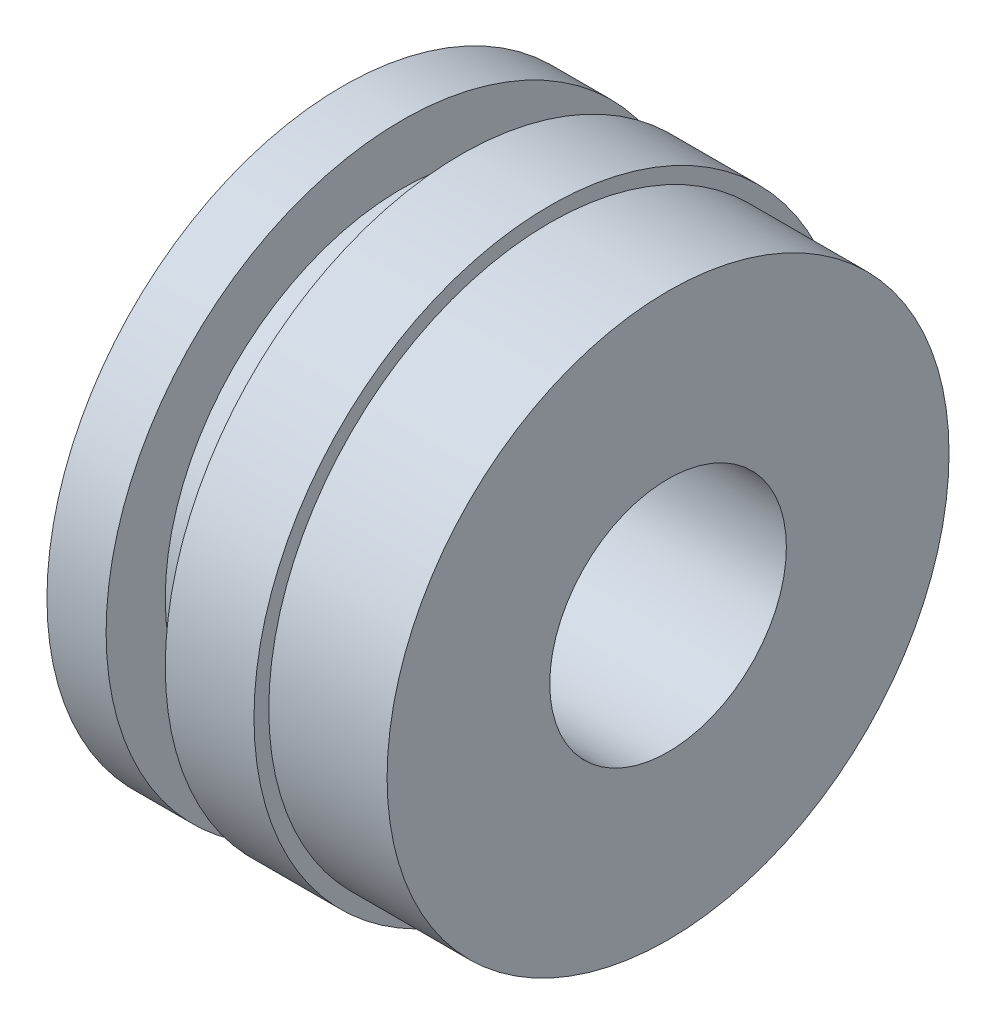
ISO-10303-21;
HEADER;
FILE_DESCRIPTION(('STEP AP214'),'2;1');
FILE_NAME('part.step','',(''),(''),'','','');
FILE_SCHEMA(('AUTOMOTIVE_DESIGN { 1 0 10303 214 1 1 1 1 }'));
ENDSEC;
DATA;
#1=APPLICATION_CONTEXT('core data for automotive mechanical design processes');
#2=APPLICATION_PROTOCOL_DEFINITION('international standard','automotive_design',2000,#1);
#3=PRODUCT_CONTEXT('',#1,'mechanical');
#4=PRODUCT('Part','Part','',(#3));
#5=PRODUCT_RELATED_PRODUCT_CATEGORY('part','',(#4));
#6=PRODUCT_DEFINITION_FORMATION('','',#4);
#7=PRODUCT_DEFINITION_CONTEXT('part definition',#1,'design');
#8=PRODUCT_DEFINITION('design','',#6,#7);
#9=PRODUCT_DEFINITION_SHAPE('','',#8);
#10=(LENGTH_UNIT() NAMED_UNIT(*) SI_UNIT(.MILLI.,.METRE.));
#11=(NAMED_UNIT(*) PLANE_ANGLE_UNIT() SI_UNIT($,.RADIAN.));
#12=(NAMED_UNIT(*) SI_UNIT($,.STERADIAN.) SOLID_ANGLE_UNIT());
#13=UNCERTAINTY_MEASURE_WITH_UNIT(LENGTH_MEASURE(1.E-05),#10,'distance_accuracy_value','');
#14=(GEOMETRIC_REPRESENTATION_CONTEXT(3) GLOBAL_UNCERTAINTY_ASSIGNED_CONTEXT((#13)) GLOBAL_UNIT_ASSIGNED_CONTEXT((#10,
#11,#12)) REPRESENTATION_CONTEXT('',''));
#15=CARTESIAN_POINT('',(0.,0.,0.));
#16=DIRECTION('',(0.,0.,1.));
#17=DIRECTION('',(1.,0.,0.));
#18=AXIS2_PLACEMENT_3D('',#15,#16,#17);
#19=CARTESIAN_POINT('',(0.,4.,0.));
#20=DIRECTION('',(1.,0.,0.));
#21=DIRECTION('',(0.,0.,-1.));
#22=AXIS2_PLACEMENT_3D('',#19,#20,#21);
#23=PLANE('',#22);
#24=CARTESIAN_POINT('',(0.,0.,0.));
#25=DIRECTION('',(-1.,0.,0.));
#26=DIRECTION('',(0.,0.,1.));
#27=AXIS2_PLACEMENT_3D('',#24,#25,#26);
#28=CIRCLE('',#27,4.);
#29=CARTESIAN_POINT('',(0.,0.,4.));
#30=VERTEX_POINT('',#29);
#31=EDGE_CURVE('E61',#30,#30,#28,.T.);
#32=ORIENTED_EDGE('',*,*,#31,.F.);
#33=EDGE_LOOP('',(#32));
#34=FACE_BOUND('',#33,.T.);
#35=CARTESIAN_POINT('',(0.,0.,0.));
#36=DIRECTION('',(-1.,0.,0.));
#37=DIRECTION('',(0.,0.,1.));
#38=AXIS2_PLACEMENT_3D('',#35,#36,#37);
#39=CIRCLE('',#38,10.);
#40=CARTESIAN_POINT('',(0.,0.,10.));
#41=VERTEX_POINT('',#40);
#42=EDGE_CURVE('E10',#41,#41,#39,.T.);
#43=ORIENTED_EDGE('',*,*,#42,.T.);
#44=EDGE_LOOP('',(#43));
#45=FACE_BOUND('',#44,.T.);
#46=ADVANCED_FACE('F27',(#34,#45),#23,.F.);
#47=CARTESIAN_POINT('',(-25.,0.,0.));
#48=DIRECTION('',(-1.,0.,0.));
#49=DIRECTION('',(0.,0.,1.));
#50=AXIS2_PLACEMENT_3D('',#47,#48,#49);
#51=CYLINDRICAL_SURFACE('',#50,10.);
#52=ORIENTED_EDGE('',*,*,#42,.F.);
#53=EDGE_LOOP('',(#52));
#54=FACE_BOUND('',#53,.T.);
#55=CARTESIAN_POINT('',(2.,0.,0.));
#56=DIRECTION('',(-1.,0.,0.));
#57=DIRECTION('',(0.,0.,1.));
#58=AXIS2_PLACEMENT_3D('',#55,#56,#57);
#59=CIRCLE('',#58,10.);
#60=CARTESIAN_POINT('',(2.,0.,10.));
#61=VERTEX_POINT('',#60);
#62=EDGE_CURVE('E33',#61,#61,#59,.T.);
#63=ORIENTED_EDGE('',*,*,#62,.T.);
#64=EDGE_LOOP('',(#63));
#65=FACE_BOUND('',#64,.T.);
#66=ADVANCED_FACE('F68',(#54,#65),#51,.T.);
#67=CARTESIAN_POINT('',(2.,10.,0.));
#68=DIRECTION('',(-1.,0.,0.));
#69=DIRECTION('',(0.,0.,1.));
#70=AXIS2_PLACEMENT_3D('',#67,#68,#69);
#71=PLANE('',#70);
#72=ORIENTED_EDGE('',*,*,#62,.F.);
#73=EDGE_LOOP('',(#72));
#74=FACE_BOUND('',#73,.T.);
#75=CARTESIAN_POINT('',(2.,0.,0.));
#76=DIRECTION('',(-1.,0.,0.));
#77=DIRECTION('',(0.,0.,1.));
#78=AXIS2_PLACEMENT_3D('',#75,#76,#77);
#79=CIRCLE('',#78,8.);
#80=CARTESIAN_POINT('',(2.,0.,8.));
#81=VERTEX_POINT('',#80);
#82=EDGE_CURVE('E37',#81,#81,#79,.T.);
#83=ORIENTED_EDGE('',*,*,#82,.T.);
#84=EDGE_LOOP('',(#83));
#85=FACE_BOUND('',#84,.T.);
#86=ADVANCED_FACE('F72',(#74,#85),#71,.F.);
#87=CARTESIAN_POINT('',(-25.,0.,0.));
#88=DIRECTION('',(-1.,0.,0.));
#89=DIRECTION('',(0.,0.,1.));
#90=AXIS2_PLACEMENT_3D('',#87,#88,#89);
#91=CYLINDRICAL_SURFACE('',#90,8.);
#92=ORIENTED_EDGE('',*,*,#82,.F.);
#93=EDGE_LOOP('',(#92));
#94=FACE_BOUND('',#93,.T.);
#95=CARTESIAN_POINT('',(4.,0.,0.));
#96=DIRECTION('',(-1.,0.,0.));
#97=DIRECTION('',(0.,0.,1.));
#98=AXIS2_PLACEMENT_3D('',#95,#96,#97);
#99=CIRCLE('',#98,8.);
#100=CARTESIAN_POINT('',(4.,0.,8.));
#101=VERTEX_POINT('',#100);
#102=EDGE_CURVE('E41',#101,#101,#99,.T.);
#103=ORIENTED_EDGE('',*,*,#102,.T.);
#104=EDGE_LOOP('',(#103));
#105=FACE_BOUND('',#104,.T.);
#106=ADVANCED_FACE('F77',(#94,#105),#91,.T.);
#107=CARTESIAN_POINT('',(4.,8.,0.));
#108=DIRECTION('',(1.,0.,0.));
#109=DIRECTION('',(0.,0.,-1.));
#110=AXIS2_PLACEMENT_3D('',#107,#108,#109);
#111=PLANE('',#110);
#112=ORIENTED_EDGE('',*,*,#102,.F.);
#113=EDGE_LOOP('',(#112));
#114=FACE_BOUND('',#113,.T.);
#115=CARTESIAN_POINT('',(4.,0.,0.));
#116=DIRECTION('',(-1.,0.,0.));
#117=DIRECTION('',(0.,0.,1.));
#118=AXIS2_PLACEMENT_3D('',#115,#116,#117);
#119=CIRCLE('',#118,10.);
#120=CARTESIAN_POINT('',(4.,0.,10.));
#121=VERTEX_POINT('',#120);
#122=EDGE_CURVE('E46',#121,#121,#119,.T.);
#123=ORIENTED_EDGE('',*,*,#122,.T.);
#124=EDGE_LOOP('',(#123));
#125=FACE_BOUND('',#124,.T.);
#126=ADVANCED_FACE('F83',(#114,#125),#111,.F.);
#127=CARTESIAN_POINT('',(-25.,0.,0.));
#128=DIRECTION('',(-1.,0.,0.));
#129=DIRECTION('',(0.,0.,1.));
#130=AXIS2_PLACEMENT_3D('',#127,#128,#129);
#131=CYLINDRICAL_SURFACE('',#130,10.);
#132=ORIENTED_EDGE('',*,*,#122,.F.);
#133=EDGE_LOOP('',(#132));
#134=FACE_BOUND('',#133,.T.);
#135=CARTESIAN_POINT('',(7.,0.,0.));
#136=DIRECTION('',(-1.,0.,0.));
#137=DIRECTION('',(0.,0.,1.));
#138=AXIS2_PLACEMENT_3D('',#135,#136,#137);
#139=CIRCLE('',#138,10.);
#140=CARTESIAN_POINT('',(7.,0.,10.));
#141=VERTEX_POINT('',#140);
#142=EDGE_CURVE('E49',#141,#141,#139,.T.);
#143=ORIENTED_EDGE('',*,*,#142,.T.);
#144=EDGE_LOOP('',(#143));
#145=FACE_BOUND('',#144,.T.);
#146=ADVANCED_FACE('F87',(#134,#145),#131,.T.);
#147=CARTESIAN_POINT('',(7.,10.,0.));
#148=DIRECTION('',(-1.,0.,0.));
#149=DIRECTION('',(0.,0.,1.));
#150=AXIS2_PLACEMENT_3D('',#147,#148,#149);
#151=PLANE('',#150);
#152=ORIENTED_EDGE('',*,*,#142,.F.);
#153=EDGE_LOOP('',(#152));
#154=FACE_BOUND('',#153,.T.);
#155=CARTESIAN_POINT('',(7.,0.,0.));
#156=DIRECTION('',(-1.,0.,0.));
#157=DIRECTION('',(0.,0.,1.));
#158=AXIS2_PLACEMENT_3D('',#155,#156,#157);
#159=CIRCLE('',#158,9.5);
#160=CARTESIAN_POINT('',(7.,0.,9.5));
#161=VERTEX_POINT('',#160);
#162=EDGE_CURVE('E52',#161,#161,#159,.T.);
#163=ORIENTED_EDGE('',*,*,#162,.T.);
#164=EDGE_LOOP('',(#163));
#165=FACE_BOUND('',#164,.T.);
#166=ADVANCED_FACE('F91',(#154,#165),#151,.F.);
#167=CARTESIAN_POINT('',(-25.,0.,0.));
#168=DIRECTION('',(-1.,0.,0.));
#169=DIRECTION('',(0.,0.,1.));
#170=AXIS2_PLACEMENT_3D('',#167,#168,#169);
#171=CYLINDRICAL_SURFACE('',#170,9.5);
#172=ORIENTED_EDGE('',*,*,#162,.F.);
#173=EDGE_LOOP('',(#172));
#174=FACE_BOUND('',#173,.T.);
#175=CARTESIAN_POINT('',(11.,0.,0.));
#176=DIRECTION('',(-1.,0.,0.));
#177=DIRECTION('',(0.,0.,1.));
#178=AXIS2_PLACEMENT_3D('',#175,#176,#177);
#179=CIRCLE('',#178,9.5);
#180=CARTESIAN_POINT('',(11.,0.,9.5));
#181=VERTEX_POINT('',#180);
#182=EDGE_CURVE('E55',#181,#181,#179,.T.);
#183=ORIENTED_EDGE('',*,*,#182,.T.);
#184=EDGE_LOOP('',(#183));
#185=FACE_BOUND('',#184,.T.);
#186=ADVANCED_FACE('F95',(#174,#185),#171,.T.);
#187=CARTESIAN_POINT('',(11.,9.5,0.));
#188=DIRECTION('',(-1.,0.,0.));
#189=DIRECTION('',(0.,0.,1.));
#190=AXIS2_PLACEMENT_3D('',#187,#188,#189);
#191=PLANE('',#190);
#192=ORIENTED_EDGE('',*,*,#182,.F.);
#193=EDGE_LOOP('',(#192));
#194=FACE_BOUND('',#193,.T.);
#195=CARTESIAN_POINT('',(11.,0.,0.));
#196=DIRECTION('',(-1.,0.,0.));
#197=DIRECTION('',(0.,0.,1.));
#198=AXIS2_PLACEMENT_3D('',#195,#196,#197);
#199=CIRCLE('',#198,4.);
#200=CARTESIAN_POINT('',(11.,0.,4.));
#201=VERTEX_POINT('',#200);
#202=EDGE_CURVE('E58',#201,#201,#199,.T.);
#203=ORIENTED_EDGE('',*,*,#202,.T.);
#204=EDGE_LOOP('',(#203));
#205=FACE_BOUND('',#204,.T.);
#206=ADVANCED_FACE('F99',(#194,#205),#191,.F.);
#207=CARTESIAN_POINT('',(-25.,0.,0.));
#208=DIRECTION('',(-1.,0.,0.));
#209=DIRECTION('',(0.,0.,1.));
#210=AXIS2_PLACEMENT_3D('',#207,#208,#209);
#211=CYLINDRICAL_SURFACE('',#210,4.);
#212=ORIENTED_EDGE('',*,*,#202,.F.);
#213=EDGE_LOOP('',(#212));
#214=FACE_BOUND('',#213,.T.);
#215=ORIENTED_EDGE('',*,*,#31,.T.);
#216=EDGE_LOOP('',(#215));
#217=FACE_BOUND('',#216,.T.);
#218=ADVANCED_FACE('F65',(#214,#217),#211,.F.);
#219=CLOSED_SHELL('',(#46,#66,#86,#106,#126,#146,#166,#186,#206,#218));
#220=MANIFOLD_SOLID_BREP('B2',#219);
#221=ADVANCED_BREP_SHAPE_REPRESENTATION('',(#18,#220),#14);
#222=SHAPE_DEFINITION_REPRESENTATION(#9,#221);
ENDSEC;
END-ISO-10303-21;
